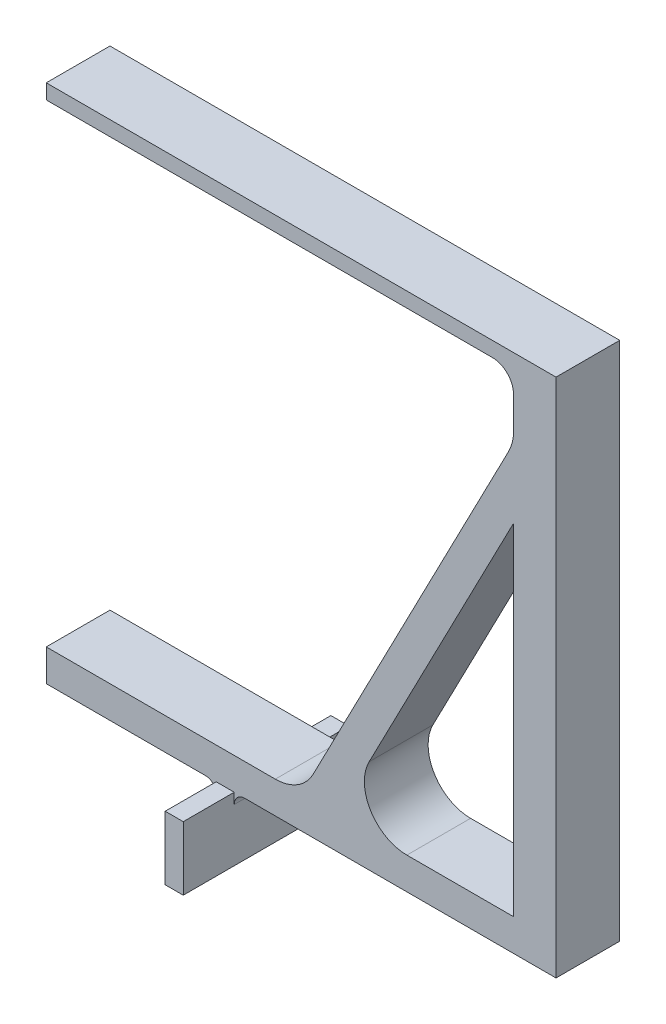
from build123d import *

# Parameters (mm, degrees)
BOSS_EXTRUDE1_DEPTH      = 3
FILLET1_R                = 2
FILLET2_R                = 1
BOSS_EXTRUDE2_DEPTH      = 2.4
BOSS_EXTRUDE2_DEPTH_BACK = 5.4
SKETCH2_W                = 0.85
SKETCH2_H                = 3
FILLET3_R                = 0.5
SKETCH3_W                = 3
SKETCH3_H                = 1.5
BOSS_EXTRUDE3_DEPTH      = 4


with BuildPart() as part:
    # Sketch1 → Boss-Extrude1 (new body)
    with BuildSketch(Plane.XY):
        Polygon((0, 3), (0, 0), (0.85, 0), (0.85, 3), (16, 3), (16, 27.5), (14, 27.5), (-8, 27.5), (-8, 26.8), (14, 26.8), (14, 23.8), (4, 4.5), (-4, 4.5), (-4, 3), align=None)
        Polygon((14, 4.5), (14, 20.539474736), (5.689391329, 4.5), align=None, mode=Mode.SUBTRACT)
    extrude(amount=BOSS_EXTRUDE1_DEPTH)

    # Fillet1
    fillet1_edges = [part.edges().sort_by_distance(p)[0] for p in [
        (4, 4.5, 1.5),
        (14, 23.8, 1.5),
        (5.689391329, 4.5, 1.5),
    ]]
    fillet(fillet1_edges, radius=FILLET1_R)

    # Fillet2
    fillet2_edges = [part.edges().sort_by_distance(p)[0] for p in [
        (14, 26.8, 1.5),
    ]]
    fillet(fillet2_edges, radius=FILLET2_R)

    # Sketch2 → Boss-Extrude2 (add, two sides: drawn at the far end of the back side and taken through both)
    with BuildSketch(Plane.XY.offset(3).offset(-BOSS_EXTRUDE2_DEPTH_BACK)):
        with Locations((0.425, 1.5)):
            Rectangle(SKETCH2_W, SKETCH2_H)
    extrude(amount=BOSS_EXTRUDE2_DEPTH + BOSS_EXTRUDE2_DEPTH_BACK)

    # Fillet3
    fillet3_edges = [part.edges().sort_by_distance(p)[0] for p in [
        (0, 3, 1.5),
        (0.85, 3, 1.5),
    ]]
    fillet(fillet3_edges, radius=FILLET3_R)

    # Sketch3 → Boss-Extrude3 (add)
    with BuildSketch(Plane.ZY.offset(4)):
        with Locations((1.5, 3.75)):
            Rectangle(SKETCH3_W, SKETCH3_H)
    extrude(amount=BOSS_EXTRUDE3_DEPTH)


solid = part.part
